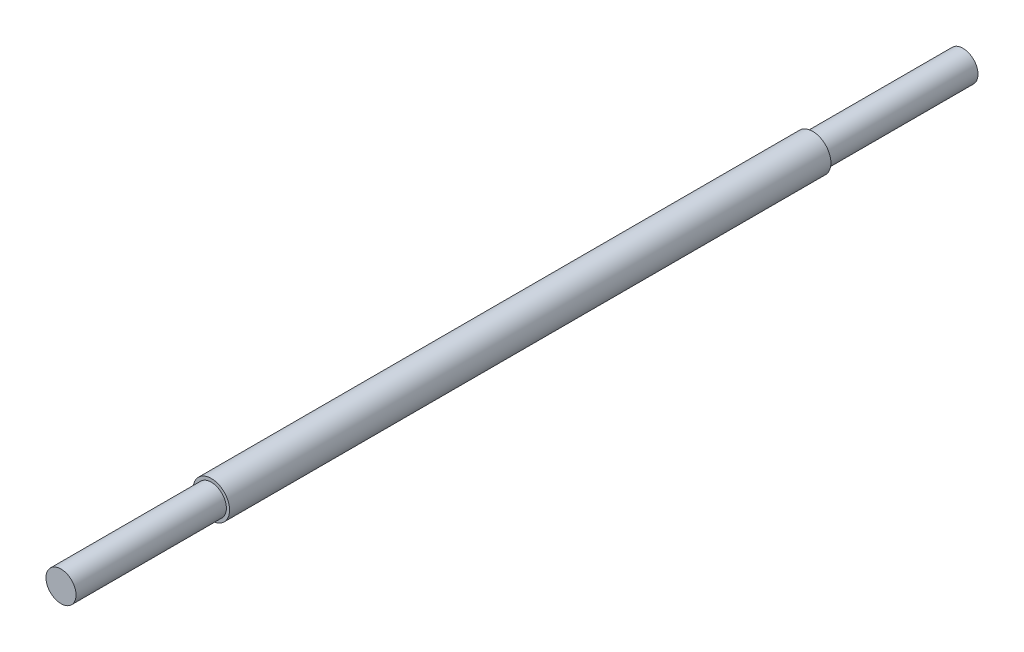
from build123d import *

# Parameters (mm, degrees)
SKETCH1_R           = 42.5
BASE_EXTRUDE_DEPTH  = 700
SKETCH2_R           = 35
BOSS_EXTRUDE1_DEPTH = 1050


with BuildPart() as part:
    # Sketch1 → Base-Extrude (new, symmetric)
    with BuildSketch(Plane.XY):
        Circle(SKETCH1_R)
    extrude(amount=BASE_EXTRUDE_DEPTH, both=True)

    # Sketch2 → Boss-Extrude1 (add, symmetric)
    with BuildSketch(Plane.XY):
        Circle(SKETCH2_R)
    extrude(amount=BOSS_EXTRUDE1_DEPTH, both=True)


solid = part.part
